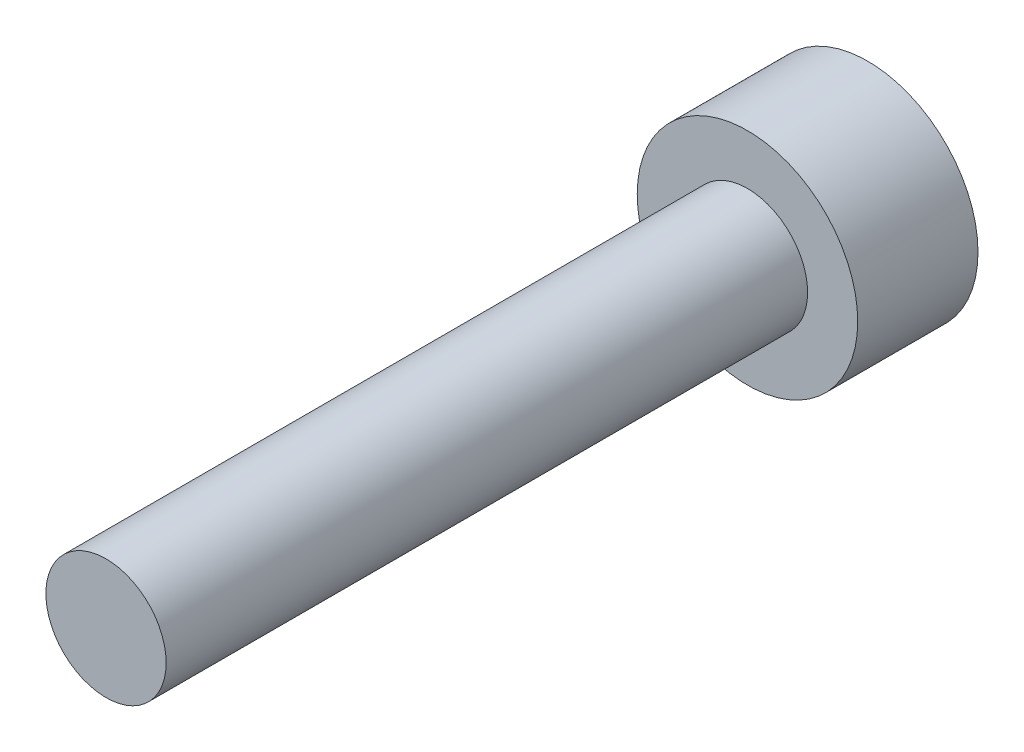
ISO-10303-21;
HEADER;
FILE_DESCRIPTION(('STEP AP214'),'2;1');
FILE_NAME('part.step','',(''),(''),'','','');
FILE_SCHEMA(('AUTOMOTIVE_DESIGN { 1 0 10303 214 1 1 1 1 }'));
ENDSEC;
DATA;
#1=APPLICATION_CONTEXT('core data for automotive mechanical design processes');
#2=APPLICATION_PROTOCOL_DEFINITION('international standard','automotive_design',2000,#1);
#3=PRODUCT_CONTEXT('',#1,'mechanical');
#4=PRODUCT('Part','Part','',(#3));
#5=PRODUCT_RELATED_PRODUCT_CATEGORY('part','',(#4));
#6=PRODUCT_DEFINITION_FORMATION('','',#4);
#7=PRODUCT_DEFINITION_CONTEXT('part definition',#1,'design');
#8=PRODUCT_DEFINITION('design','',#6,#7);
#9=PRODUCT_DEFINITION_SHAPE('','',#8);
#10=(LENGTH_UNIT() NAMED_UNIT(*) SI_UNIT(.MILLI.,.METRE.));
#11=(NAMED_UNIT(*) PLANE_ANGLE_UNIT() SI_UNIT($,.RADIAN.));
#12=(NAMED_UNIT(*) SI_UNIT($,.STERADIAN.) SOLID_ANGLE_UNIT());
#13=UNCERTAINTY_MEASURE_WITH_UNIT(LENGTH_MEASURE(1.E-05),#10,'distance_accuracy_value','');
#14=(GEOMETRIC_REPRESENTATION_CONTEXT(3) GLOBAL_UNCERTAINTY_ASSIGNED_CONTEXT((#13)) GLOBAL_UNIT_ASSIGNED_CONTEXT((#10,
#11,#12)) REPRESENTATION_CONTEXT('',''));
#15=CARTESIAN_POINT('',(0.,0.,0.));
#16=DIRECTION('',(0.,0.,1.));
#17=DIRECTION('',(1.,0.,0.));
#18=AXIS2_PLACEMENT_3D('',#15,#16,#17);
#19=CARTESIAN_POINT('',(0.,0.,0.));
#20=DIRECTION('',(0.,0.,-1.));
#21=DIRECTION('',(-1.,0.,0.));
#22=AXIS2_PLACEMENT_3D('',#19,#20,#21);
#23=CYLINDRICAL_SURFACE('',#22,2.75);
#24=CARTESIAN_POINT('',(0.,0.,0.));
#25=DIRECTION('',(0.,0.,1.));
#26=DIRECTION('',(1.,0.,0.));
#27=AXIS2_PLACEMENT_3D('',#24,#25,#26);
#28=CIRCLE('',#27,2.75);
#29=CARTESIAN_POINT('',(2.75,0.,0.));
#30=VERTEX_POINT('',#29);
#31=EDGE_CURVE('E48',#30,#30,#28,.T.);
#32=ORIENTED_EDGE('',*,*,#31,.F.);
#33=EDGE_LOOP('',(#32));
#34=FACE_BOUND('',#33,.T.);
#35=CARTESIAN_POINT('',(0.,0.,-3.));
#36=DIRECTION('',(0.,0.,1.));
#37=DIRECTION('',(1.,0.,0.));
#38=AXIS2_PLACEMENT_3D('',#35,#36,#37);
#39=CIRCLE('',#38,2.75);
#40=CARTESIAN_POINT('',(2.75,0.,-3.));
#41=VERTEX_POINT('',#40);
#42=EDGE_CURVE('E44',#41,#41,#39,.T.);
#43=ORIENTED_EDGE('',*,*,#42,.T.);
#44=EDGE_LOOP('',(#43));
#45=FACE_BOUND('',#44,.T.);
#46=ADVANCED_FACE('F41',(#34,#45),#23,.T.);
#47=CARTESIAN_POINT('',(0.,0.,0.));
#48=DIRECTION('',(0.,0.,1.));
#49=DIRECTION('',(1.,0.,0.));
#50=AXIS2_PLACEMENT_3D('',#47,#48,#49);
#51=PLANE('',#50);
#52=CARTESIAN_POINT('',(0.,0.,0.));
#53=DIRECTION('',(0.,0.,1.));
#54=DIRECTION('',(1.,0.,0.));
#55=AXIS2_PLACEMENT_3D('',#52,#53,#54);
#56=CIRCLE('',#55,1.5);
#57=CARTESIAN_POINT('',(1.5,0.,0.));
#58=VERTEX_POINT('',#57);
#59=EDGE_CURVE('E10',#58,#58,#56,.T.);
#60=ORIENTED_EDGE('',*,*,#59,.F.);
#61=EDGE_LOOP('',(#60));
#62=FACE_BOUND('',#61,.T.);
#63=ORIENTED_EDGE('',*,*,#31,.T.);
#64=EDGE_LOOP('',(#63));
#65=FACE_BOUND('',#64,.T.);
#66=ADVANCED_FACE('F65',(#62,#65),#51,.T.);
#67=CARTESIAN_POINT('',(0.,0.,-3.));
#68=DIRECTION('',(0.,0.,1.));
#69=DIRECTION('',(1.,0.,0.));
#70=AXIS2_PLACEMENT_3D('',#67,#68,#69);
#71=PLANE('',#70);
#72=ORIENTED_EDGE('',*,*,#42,.F.);
#73=EDGE_LOOP('',(#72));
#74=FACE_BOUND('',#73,.T.);
#75=ADVANCED_FACE('F62',(#74),#71,.F.);
#76=CARTESIAN_POINT('',(0.,0.,16.));
#77=DIRECTION('',(0.,0.,-1.));
#78=DIRECTION('',(-1.,0.,0.));
#79=AXIS2_PLACEMENT_3D('',#76,#77,#78);
#80=CYLINDRICAL_SURFACE('',#79,1.5);
#81=CARTESIAN_POINT('',(0.,0.,16.));
#82=DIRECTION('',(0.,0.,1.));
#83=DIRECTION('',(1.,0.,0.));
#84=AXIS2_PLACEMENT_3D('',#81,#82,#83);
#85=CIRCLE('',#84,1.5);
#86=CARTESIAN_POINT('',(1.5,0.,16.));
#87=VERTEX_POINT('',#86);
#88=EDGE_CURVE('E54',#87,#87,#85,.T.);
#89=ORIENTED_EDGE('',*,*,#88,.F.);
#90=EDGE_LOOP('',(#89));
#91=FACE_BOUND('',#90,.T.);
#92=ORIENTED_EDGE('',*,*,#59,.T.);
#93=EDGE_LOOP('',(#92));
#94=FACE_BOUND('',#93,.T.);
#95=ADVANCED_FACE('F64',(#91,#94),#80,.T.);
#96=CARTESIAN_POINT('',(0.,0.,16.));
#97=DIRECTION('',(0.,0.,1.));
#98=DIRECTION('',(1.,0.,0.));
#99=AXIS2_PLACEMENT_3D('',#96,#97,#98);
#100=PLANE('',#99);
#101=ORIENTED_EDGE('',*,*,#88,.T.);
#102=EDGE_LOOP('',(#101));
#103=FACE_BOUND('',#102,.T.);
#104=ADVANCED_FACE('F71',(#103),#100,.T.);
#105=CLOSED_SHELL('',(#46,#66,#75,#95,#104));
#106=MANIFOLD_SOLID_BREP('B2',#105);
#107=ADVANCED_BREP_SHAPE_REPRESENTATION('',(#18,#106),#14);
#108=SHAPE_DEFINITION_REPRESENTATION(#9,#107);
ENDSEC;
END-ISO-10303-21;
